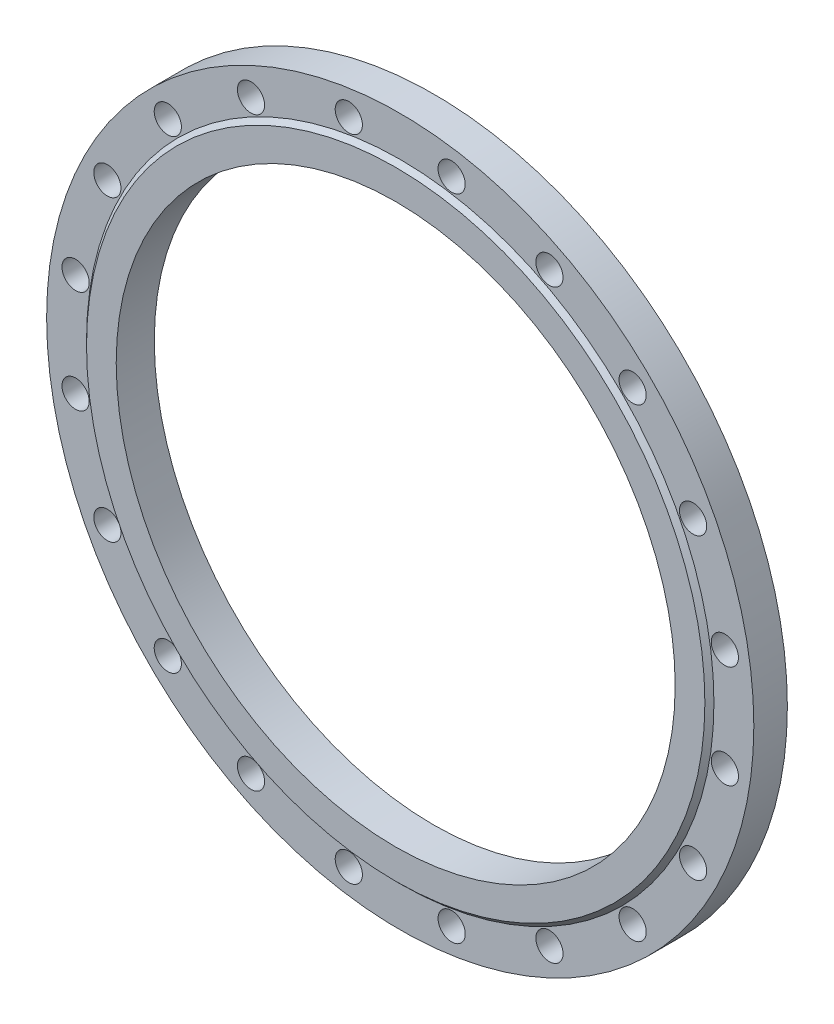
from build123d import *

# Parameters (mm, degrees)
ESQUISSE4_R             = 15
ENL_V_MAT_EXTRU_1_DEPTH = 553.782959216


with BuildPart() as part:
    # Esquisse3 → R_volution1 (revolve)
    with BuildSketch(Plane(origin=(0, 0, 0), x_dir=(0, 0, -1), z_dir=(1, 0, 0)), mode=Mode.PRIVATE) as r_volution1_sk:
        Polygon((-8, 390), (29, 390), (29, 308.25), (-13, 308.25), (-13, 341), (-8, 346), align=None)
    revolve(r_volution1_sk.sketch.rotate(Axis((0, 0, 0), (0, 0, 1)), 90), axis=Axis((0, 0, 0), (0, 0, 1)))

    # Esquisse4 → Enl_v. mat.-Extru.1 (cut, through all)
    with BuildSketch(Plane.XY.offset(8)):
        with Locations((358.037023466, 56.707493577)):
            Circle(ESQUISSE4_R)
        with Locations((358.037023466, -56.707493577)):
            Circle(ESQUISSE4_R)
        with Locations((322.989865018, -164.571556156)):
            Circle(ESQUISSE4_R)
        with Locations((256.32620818, -256.32620818)):
            Circle(ESQUISSE4_R)
        with Locations((164.571556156, -322.989865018)):
            Circle(ESQUISSE4_R)
        with Locations((56.707493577, -358.037023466)):
            Circle(ESQUISSE4_R)
        with Locations((-56.707493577, -358.037023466)):
            Circle(ESQUISSE4_R)
        with Locations((-164.571556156, -322.989865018)):
            Circle(ESQUISSE4_R)
        with Locations((-256.32620818, -256.32620818)):
            Circle(ESQUISSE4_R)
        with Locations((-322.989865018, -164.571556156)):
            Circle(ESQUISSE4_R)
        with Locations((-358.037023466, -56.707493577)):
            Circle(ESQUISSE4_R)
        with Locations((-358.037023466, 56.707493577)):
            Circle(ESQUISSE4_R)
        with Locations((-322.989865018, 164.571556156)):
            Circle(ESQUISSE4_R)
        with Locations((-256.32620818, 256.32620818)):
            Circle(ESQUISSE4_R)
        with Locations((-164.571556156, 322.989865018)):
            Circle(ESQUISSE4_R)
        with Locations((-56.707493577, 358.037023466)):
            Circle(ESQUISSE4_R)
        with Locations((56.707493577, 358.037023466)):
            Circle(ESQUISSE4_R)
        with Locations((164.571556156, 322.989865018)):
            Circle(ESQUISSE4_R)
        with Locations((256.32620818, 256.32620818)):
            Circle(ESQUISSE4_R)
        with Locations((322.989865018, 164.571556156)):
            Circle(ESQUISSE4_R)
    extrude(amount=-ENL_V_MAT_EXTRU_1_DEPTH, mode=Mode.SUBTRACT)


solid = part.part
